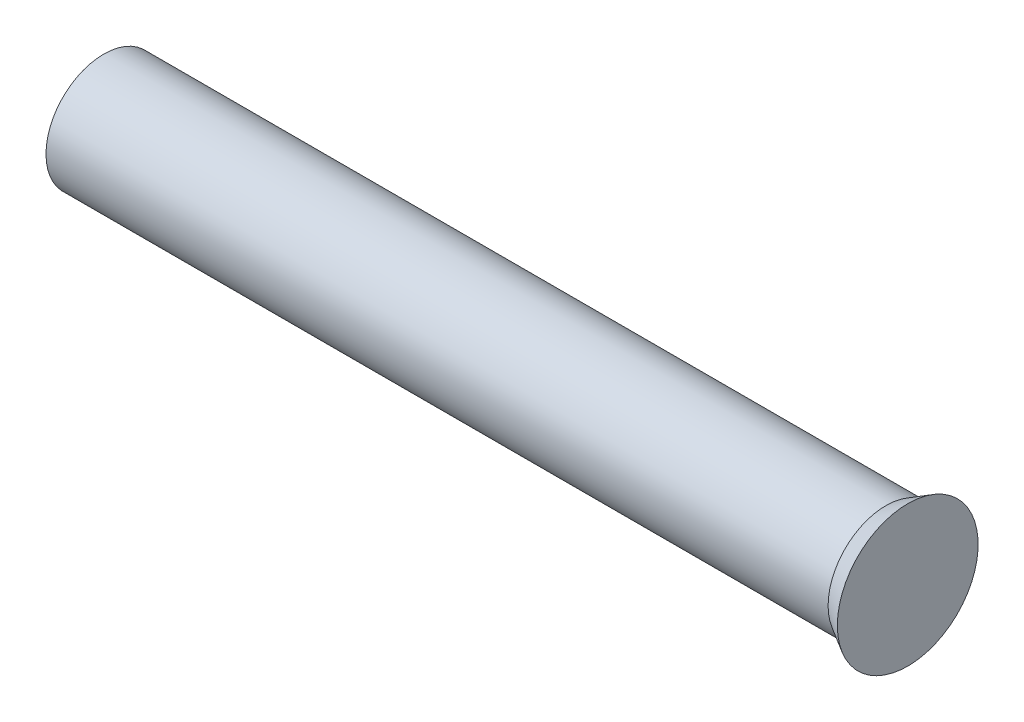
from build123d import *


with BuildPart() as part:
    # Sketch1 → Revolve1 (revolve)
    with BuildSketch(Plane.XY, mode=Mode.PRIVATE) as revolve1_sk:
        with BuildLine():
            Line((0, 0), (19.812, 0))
            Line((19.812, 0), (19.812, 1.702))
            Line((19.812, 1.702), (19.283724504, 1.397))
            Line((19.283724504, 1.397), (0.374325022, 1.397))
            ThreePointArc((0.374325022, 1.397), (0.095203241, 0.723140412), (0, 0))
        make_face()
    revolve(revolve1_sk.sketch.rotate(Axis((0, 0, 0), (1, 0, 0)), 90), axis=Axis((0, 0, 0), (1, 0, 0)))


solid = part.part
